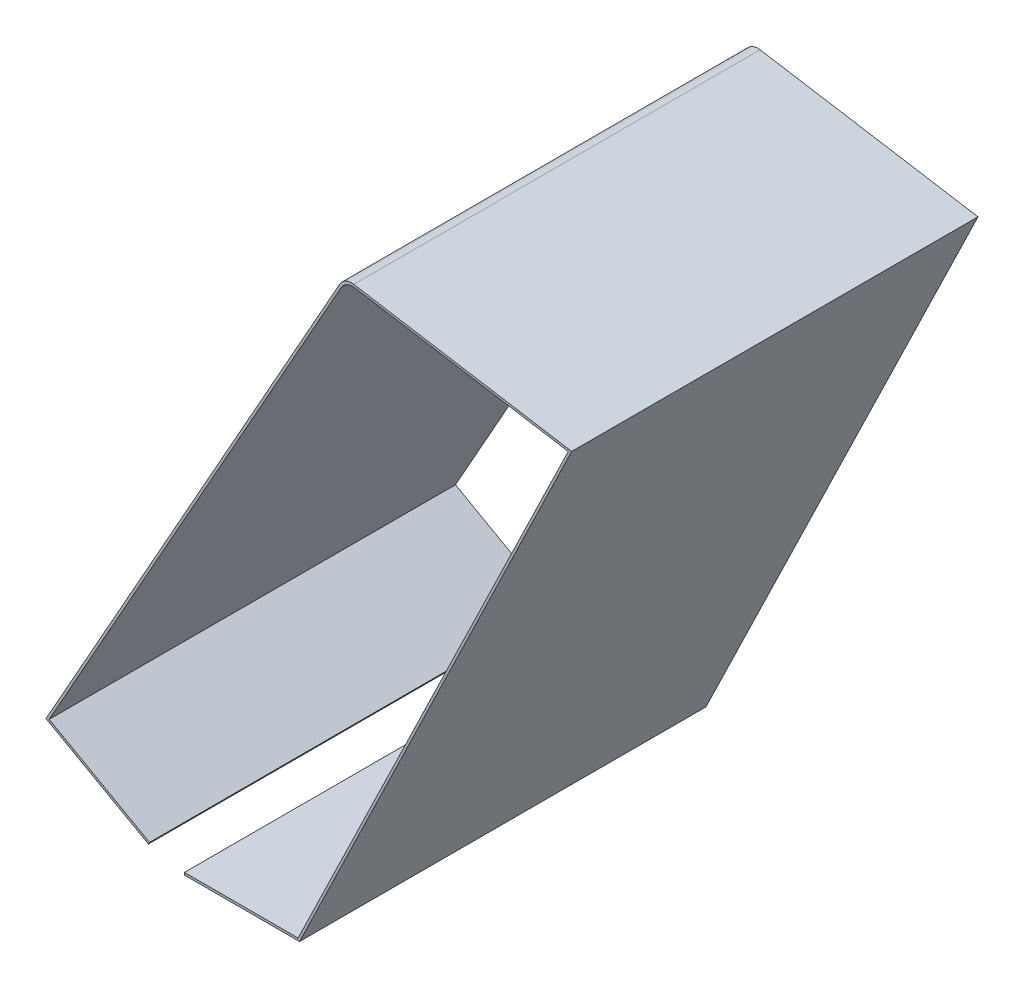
ISO-10303-21;
HEADER;
FILE_DESCRIPTION(('STEP AP214'),'2;1');
FILE_NAME('part.step','',(''),(''),'','','');
FILE_SCHEMA(('AUTOMOTIVE_DESIGN { 1 0 10303 214 1 1 1 1 }'));
ENDSEC;
DATA;
#1=APPLICATION_CONTEXT('core data for automotive mechanical design processes');
#2=APPLICATION_PROTOCOL_DEFINITION('international standard','automotive_design',2000,#1);
#3=PRODUCT_CONTEXT('',#1,'mechanical');
#4=PRODUCT('Part','Part','',(#3));
#5=PRODUCT_RELATED_PRODUCT_CATEGORY('part','',(#4));
#6=PRODUCT_DEFINITION_FORMATION('','',#4);
#7=PRODUCT_DEFINITION_CONTEXT('part definition',#1,'design');
#8=PRODUCT_DEFINITION('design','',#6,#7);
#9=PRODUCT_DEFINITION_SHAPE('','',#8);
#10=(LENGTH_UNIT() NAMED_UNIT(*) SI_UNIT(.MILLI.,.METRE.));
#11=(NAMED_UNIT(*) PLANE_ANGLE_UNIT() SI_UNIT($,.RADIAN.));
#12=(NAMED_UNIT(*) SI_UNIT($,.STERADIAN.) SOLID_ANGLE_UNIT());
#13=UNCERTAINTY_MEASURE_WITH_UNIT(LENGTH_MEASURE(1.E-05),#10,'distance_accuracy_value','');
#14=(GEOMETRIC_REPRESENTATION_CONTEXT(3) GLOBAL_UNCERTAINTY_ASSIGNED_CONTEXT((#13)) GLOBAL_UNIT_ASSIGNED_CONTEXT((#10,
#11,#12)) REPRESENTATION_CONTEXT('',''));
#15=CARTESIAN_POINT('',(0.,0.,0.));
#16=DIRECTION('',(0.,0.,1.));
#17=DIRECTION('',(1.,0.,0.));
#18=AXIS2_PLACEMENT_3D('',#15,#16,#17);
#19=CARTESIAN_POINT('',(-22.0333053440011,-39.2368889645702,30.));
#20=DIRECTION('',(0.48962900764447,0.871930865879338,0.));
#21=DIRECTION('',(-0.871930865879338,0.48962900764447,0.));
#22=AXIS2_PLACEMENT_3D('',#19,#20,#21);
#23=PLANE('',#22);
#24=DIRECTION('',(0.871930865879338,-0.48962900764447,0.));
#25=VECTOR('',#24,1.);
#26=CARTESIAN_POINT('',(-22.0333053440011,-39.2368889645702,0.));
#27=LINE('',#26,#25);
#28=CARTESIAN_POINT('',(-22.0333053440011,-39.2368889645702,0.));
#29=VERTEX_POINT('',#28);
#30=CARTESIAN_POINT('',(-14.4736647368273,-43.4819724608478,0.));
#31=VERTEX_POINT('',#30);
#32=EDGE_CURVE('E169',#29,#31,#27,.T.);
#33=ORIENTED_EDGE('',*,*,#32,.T.);
#34=DIRECTION('',(0.,0.,-1.));
#35=VECTOR('',#34,1.);
#36=CARTESIAN_POINT('',(-14.4736647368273,-43.4819724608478,30.));
#37=LINE('',#36,#35);
#38=CARTESIAN_POINT('',(-14.4736647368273,-43.4819724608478,30.));
#39=VERTEX_POINT('',#38);
#40=EDGE_CURVE('E11',#39,#31,#37,.T.);
#41=ORIENTED_EDGE('',*,*,#40,.F.);
#42=DIRECTION('',(0.871930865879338,-0.48962900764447,0.));
#43=VECTOR('',#42,1.);
#44=CARTESIAN_POINT('',(-22.0333053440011,-39.2368889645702,30.));
#45=LINE('',#44,#43);
#46=CARTESIAN_POINT('',(-22.0333053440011,-39.2368889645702,30.));
#47=VERTEX_POINT('',#46);
#48=EDGE_CURVE('E195',#47,#39,#45,.T.);
#49=ORIENTED_EDGE('',*,*,#48,.F.);
#50=DIRECTION('',(0.,0.,-1.));
#51=VECTOR('',#50,1.);
#52=CARTESIAN_POINT('',(-22.0333053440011,-39.2368889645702,30.));
#53=LINE('',#52,#51);
#54=EDGE_CURVE('E165',#47,#29,#53,.T.);
#55=ORIENTED_EDGE('',*,*,#54,.T.);
#56=EDGE_LOOP('',(#33,#41,#49,#55));
#57=FACE_BOUND('',#56,.T.);
#58=ADVANCED_FACE('F37',(#57),#23,.F.);
#59=CARTESIAN_POINT('',(-14.3904278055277,-43.3337442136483,30.));
#60=DIRECTION('',(-0.871930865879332,0.489629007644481,0.));
#61=DIRECTION('',(-0.489629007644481,-0.871930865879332,0.));
#62=AXIS2_PLACEMENT_3D('',#59,#60,#61);
#63=PLANE('',#62);
#64=DIRECTION('',(0.489629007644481,0.871930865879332,0.));
#65=VECTOR('',#64,1.);
#66=CARTESIAN_POINT('',(-14.3904278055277,-43.3337442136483,0.));
#67=LINE('',#66,#65);
#68=CARTESIAN_POINT('',(-14.3904278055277,-43.3337442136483,0.));
#69=VERTEX_POINT('',#68);
#70=EDGE_CURVE('E172',#31,#69,#67,.T.);
#71=ORIENTED_EDGE('',*,*,#70,.T.);
#72=DIRECTION('',(0.,0.,-1.));
#73=VECTOR('',#72,1.);
#74=CARTESIAN_POINT('',(-14.3904278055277,-43.3337442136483,30.));
#75=LINE('',#74,#73);
#76=CARTESIAN_POINT('',(-14.3904278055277,-43.3337442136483,30.));
#77=VERTEX_POINT('',#76);
#78=EDGE_CURVE('E45',#77,#69,#75,.T.);
#79=ORIENTED_EDGE('',*,*,#78,.F.);
#80=DIRECTION('',(0.489629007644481,0.871930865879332,0.));
#81=VECTOR('',#80,1.);
#82=CARTESIAN_POINT('',(-14.3904278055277,-43.3337442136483,30.));
#83=LINE('',#82,#81);
#84=EDGE_CURVE('E114',#39,#77,#83,.T.);
#85=ORIENTED_EDGE('',*,*,#84,.F.);
#86=ORIENTED_EDGE('',*,*,#40,.T.);
#87=EDGE_LOOP('',(#71,#79,#85,#86));
#88=FACE_BOUND('',#87,.T.);
#89=ADVANCED_FACE('F283',(#88),#63,.F.);
#90=CARTESIAN_POINT('',(-21.8018401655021,-39.1718976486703,30.));
#91=DIRECTION('',(-0.48962900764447,-0.871930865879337,0.));
#92=DIRECTION('',(0.871930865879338,-0.48962900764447,0.));
#93=AXIS2_PLACEMENT_3D('',#90,#91,#92);
#94=PLANE('',#93);
#95=DIRECTION('',(-0.871930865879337,0.48962900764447,0.));
#96=VECTOR('',#95,1.);
#97=CARTESIAN_POINT('',(-21.8018401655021,-39.1718976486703,0.));
#98=LINE('',#97,#96);
#99=CARTESIAN_POINT('',(-21.8018401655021,-39.1718976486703,0.));
#100=VERTEX_POINT('',#99);
#101=EDGE_CURVE('E174',#69,#100,#98,.T.);
#102=ORIENTED_EDGE('',*,*,#101,.T.);
#103=DIRECTION('',(0.,0.,-1.));
#104=VECTOR('',#103,1.);
#105=CARTESIAN_POINT('',(-21.8018401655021,-39.1718976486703,30.));
#106=LINE('',#105,#104);
#107=CARTESIAN_POINT('',(-21.8018401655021,-39.1718976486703,30.));
#108=VERTEX_POINT('',#107);
#109=EDGE_CURVE('E220',#108,#100,#106,.T.);
#110=ORIENTED_EDGE('',*,*,#109,.F.);
#111=DIRECTION('',(-0.871930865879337,0.48962900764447,0.));
#112=VECTOR('',#111,1.);
#113=CARTESIAN_POINT('',(-21.8018401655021,-39.1718976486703,30.));
#114=LINE('',#113,#112);
#115=EDGE_CURVE('E228',#77,#108,#114,.T.);
#116=ORIENTED_EDGE('',*,*,#115,.F.);
#117=ORIENTED_EDGE('',*,*,#78,.T.);
#118=EDGE_LOOP('',(#102,#110,#116,#117));
#119=FACE_BOUND('',#118,.T.);
#120=ADVANCED_FACE('F226',(#119),#94,.F.);
#121=CARTESIAN_POINT('',(-0.252896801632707,-0.797560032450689,30.));
#122=DIRECTION('',(-0.871930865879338,0.48962900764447,0.));
#123=DIRECTION('',(-0.48962900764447,-0.871930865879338,0.));
#124=AXIS2_PLACEMENT_3D('',#121,#122,#123);
#125=PLANE('',#124);
#126=DIRECTION('',(0.48962900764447,0.871930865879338,0.));
#127=VECTOR('',#126,1.);
#128=CARTESIAN_POINT('',(-0.252896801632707,-0.797560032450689,0.));
#129=LINE('',#128,#127);
#130=CARTESIAN_POINT('',(-0.252896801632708,-0.797560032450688,0.));
#131=VERTEX_POINT('',#130);
#132=EDGE_CURVE('E176',#100,#131,#129,.T.);
#133=ORIENTED_EDGE('',*,*,#132,.T.);
#134=DIRECTION('',(0.,0.,-1.));
#135=VECTOR('',#134,1.);
#136=CARTESIAN_POINT('',(-0.252896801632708,-0.797560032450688,30.));
#137=LINE('',#136,#135);
#138=CARTESIAN_POINT('',(-0.252896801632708,-0.797560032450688,30.));
#139=VERTEX_POINT('',#138);
#140=EDGE_CURVE('E217',#139,#131,#137,.T.);
#141=ORIENTED_EDGE('',*,*,#140,.F.);
#142=DIRECTION('',(0.48962900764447,0.871930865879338,0.));
#143=VECTOR('',#142,1.);
#144=CARTESIAN_POINT('',(-0.252896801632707,-0.797560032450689,30.));
#145=LINE('',#144,#143);
#146=EDGE_CURVE('E246',#108,#139,#145,.T.);
#147=ORIENTED_EDGE('',*,*,#146,.F.);
#148=ORIENTED_EDGE('',*,*,#109,.T.);
#149=EDGE_LOOP('',(#133,#141,#147,#148));
#150=FACE_BOUND('',#149,.T.);
#151=ADVANCED_FACE('F237',(#150),#125,.F.);
#152=CARTESIAN_POINT('',(0.61903406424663,-1.28718904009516,30.));
#153=DIRECTION('',(0.,0.,-1.));
#154=DIRECTION('',(-1.,0.,0.));
#155=AXIS2_PLACEMENT_3D('',#152,#153,#154);
#156=CYLINDRICAL_SURFACE('',#155,1.);
#157=CARTESIAN_POINT('',(0.61903406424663,-1.28718904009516,0.));
#158=DIRECTION('',(0.,0.,-1.));
#159=DIRECTION('',(1.,0.,0.));
#160=AXIS2_PLACEMENT_3D('',#157,#158,#159);
#161=CIRCLE('',#160,1.);
#162=CARTESIAN_POINT('',(0.780916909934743,-0.300379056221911,0.));
#163=VERTEX_POINT('',#162);
#164=EDGE_CURVE('E178',#131,#163,#161,.T.);
#165=ORIENTED_EDGE('',*,*,#164,.T.);
#166=DIRECTION('',(0.,0.,-1.));
#167=VECTOR('',#166,1.);
#168=CARTESIAN_POINT('',(0.780916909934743,-0.300379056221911,30.));
#169=LINE('',#168,#167);
#170=CARTESIAN_POINT('',(0.780916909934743,-0.300379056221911,30.));
#171=VERTEX_POINT('',#170);
#172=EDGE_CURVE('E214',#171,#163,#169,.T.);
#173=ORIENTED_EDGE('',*,*,#172,.F.);
#174=CARTESIAN_POINT('',(0.61903406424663,-1.28718904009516,30.));
#175=DIRECTION('',(0.,0.,-1.));
#176=DIRECTION('',(1.,0.,0.));
#177=AXIS2_PLACEMENT_3D('',#174,#175,#176);
#178=CIRCLE('',#177,1.);
#179=EDGE_CURVE('E243',#139,#171,#178,.T.);
#180=ORIENTED_EDGE('',*,*,#179,.F.);
#181=ORIENTED_EDGE('',*,*,#140,.T.);
#182=EDGE_LOOP('',(#165,#173,#180,#181));
#183=FACE_BOUND('',#182,.T.);
#184=ADVANCED_FACE('F241',(#183),#156,.F.);
#185=CARTESIAN_POINT('',(16.5232694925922,-2.8828588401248,30.));
#186=DIRECTION('',(0.161882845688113,0.986809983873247,0.));
#187=DIRECTION('',(-0.986809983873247,0.161882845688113,0.));
#188=AXIS2_PLACEMENT_3D('',#185,#186,#187);
#189=PLANE('',#188);
#190=DIRECTION('',(0.986809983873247,-0.161882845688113,0.));
#191=VECTOR('',#190,1.);
#192=CARTESIAN_POINT('',(16.5232694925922,-2.8828588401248,0.));
#193=LINE('',#192,#191);
#194=CARTESIAN_POINT('',(16.5232694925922,-2.8828588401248,0.));
#195=VERTEX_POINT('',#194);
#196=EDGE_CURVE('E180',#163,#195,#193,.T.);
#197=ORIENTED_EDGE('',*,*,#196,.T.);
#198=DIRECTION('',(0.,0.,-1.));
#199=VECTOR('',#198,1.);
#200=CARTESIAN_POINT('',(16.5232694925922,-2.8828588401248,30.));
#201=LINE('',#200,#199);
#202=CARTESIAN_POINT('',(16.5232694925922,-2.8828588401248,30.));
#203=VERTEX_POINT('',#202);
#204=EDGE_CURVE('E211',#203,#195,#201,.T.);
#205=ORIENTED_EDGE('',*,*,#204,.F.);
#206=DIRECTION('',(0.986809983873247,-0.161882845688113,0.));
#207=VECTOR('',#206,1.);
#208=CARTESIAN_POINT('',(16.5232694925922,-2.8828588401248,30.));
#209=LINE('',#208,#207);
#210=EDGE_CURVE('E245',#171,#203,#209,.T.);
#211=ORIENTED_EDGE('',*,*,#210,.F.);
#212=ORIENTED_EDGE('',*,*,#172,.T.);
#213=EDGE_LOOP('',(#197,#205,#211,#212));
#214=FACE_BOUND('',#213,.T.);
#215=ADVANCED_FACE('F296',(#214),#189,.F.);
#216=CARTESIAN_POINT('',(-3.4204397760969,-43.9631790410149,30.));
#217=DIRECTION('',(0.899590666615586,-0.436734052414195,0.));
#218=DIRECTION('',(0.436734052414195,0.899590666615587,0.));
#219=AXIS2_PLACEMENT_3D('',#216,#217,#218);
#220=PLANE('',#219);
#221=DIRECTION('',(-0.436734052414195,-0.899590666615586,0.));
#222=VECTOR('',#221,1.);
#223=CARTESIAN_POINT('',(-3.4204397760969,-43.9631790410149,0.));
#224=LINE('',#223,#222);
#225=CARTESIAN_POINT('',(-3.4204397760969,-43.9631790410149,0.));
#226=VERTEX_POINT('',#225);
#227=EDGE_CURVE('E182',#195,#226,#224,.T.);
#228=ORIENTED_EDGE('',*,*,#227,.T.);
#229=DIRECTION('',(0.,0.,-1.));
#230=VECTOR('',#229,1.);
#231=CARTESIAN_POINT('',(-3.4204397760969,-43.9631790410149,30.));
#232=LINE('',#231,#230);
#233=CARTESIAN_POINT('',(-3.4204397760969,-43.9631790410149,30.));
#234=VERTEX_POINT('',#233);
#235=EDGE_CURVE('E208',#234,#226,#232,.T.);
#236=ORIENTED_EDGE('',*,*,#235,.F.);
#237=DIRECTION('',(-0.436734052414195,-0.899590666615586,0.));
#238=VECTOR('',#237,1.);
#239=CARTESIAN_POINT('',(-3.4204397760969,-43.9631790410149,30.));
#240=LINE('',#239,#238);
#241=EDGE_CURVE('E248',#203,#234,#240,.T.);
#242=ORIENTED_EDGE('',*,*,#241,.F.);
#243=ORIENTED_EDGE('',*,*,#204,.T.);
#244=EDGE_LOOP('',(#228,#236,#242,#243));
#245=FACE_BOUND('',#244,.T.);
#246=ADVANCED_FACE('F299',(#245),#220,.F.);
#247=CARTESIAN_POINT('',(-11.8139966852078,-43.9631790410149,30.));
#248=DIRECTION('',(0.,-1.,0.));
#249=DIRECTION('',(0.,0.,-1.));
#250=AXIS2_PLACEMENT_3D('',#247,#248,#249);
#251=PLANE('',#250);
#252=DIRECTION('',(-1.,0.,0.));
#253=VECTOR('',#252,1.);
#254=CARTESIAN_POINT('',(-11.8139966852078,-43.9631790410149,0.));
#255=LINE('',#254,#253);
#256=CARTESIAN_POINT('',(-11.8139966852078,-43.9631790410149,0.));
#257=VERTEX_POINT('',#256);
#258=EDGE_CURVE('E184',#226,#257,#255,.T.);
#259=ORIENTED_EDGE('',*,*,#258,.T.);
#260=DIRECTION('',(0.,0.,-1.));
#261=VECTOR('',#260,1.);
#262=CARTESIAN_POINT('',(-11.8139966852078,-43.9631790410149,30.));
#263=LINE('',#262,#261);
#264=CARTESIAN_POINT('',(-11.8139966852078,-43.9631790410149,30.));
#265=VERTEX_POINT('',#264);
#266=EDGE_CURVE('E205',#265,#257,#263,.T.);
#267=ORIENTED_EDGE('',*,*,#266,.F.);
#268=DIRECTION('',(-1.,0.,0.));
#269=VECTOR('',#268,1.);
#270=CARTESIAN_POINT('',(-11.8139966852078,-43.9631790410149,30.));
#271=LINE('',#270,#269);
#272=EDGE_CURVE('E254',#234,#265,#271,.T.);
#273=ORIENTED_EDGE('',*,*,#272,.F.);
#274=ORIENTED_EDGE('',*,*,#235,.T.);
#275=EDGE_LOOP('',(#259,#267,#273,#274));
#276=FACE_BOUND('',#275,.T.);
#277=ADVANCED_FACE('F303',(#276),#251,.F.);
#278=CARTESIAN_POINT('',(-11.8139966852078,-44.1331790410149,30.));
#279=DIRECTION('',(1.,0.,0.));
#280=DIRECTION('',(0.,0.,-1.));
#281=AXIS2_PLACEMENT_3D('',#278,#279,#280);
#282=PLANE('',#281);
#283=DIRECTION('',(0.,-1.,0.));
#284=VECTOR('',#283,1.);
#285=CARTESIAN_POINT('',(-11.8139966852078,-44.1331790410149,0.));
#286=LINE('',#285,#284);
#287=CARTESIAN_POINT('',(-11.8139966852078,-44.1331790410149,0.));
#288=VERTEX_POINT('',#287);
#289=EDGE_CURVE('E186',#257,#288,#286,.T.);
#290=ORIENTED_EDGE('',*,*,#289,.T.);
#291=DIRECTION('',(0.,0.,-1.));
#292=VECTOR('',#291,1.);
#293=CARTESIAN_POINT('',(-11.8139966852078,-44.1331790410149,30.));
#294=LINE('',#293,#292);
#295=CARTESIAN_POINT('',(-11.8139966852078,-44.1331790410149,30.));
#296=VERTEX_POINT('',#295);
#297=EDGE_CURVE('E202',#296,#288,#294,.T.);
#298=ORIENTED_EDGE('',*,*,#297,.F.);
#299=DIRECTION('',(0.,-1.,0.));
#300=VECTOR('',#299,1.);
#301=CARTESIAN_POINT('',(-11.8139966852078,-44.1331790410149,30.));
#302=LINE('',#301,#300);
#303=EDGE_CURVE('E256',#265,#296,#302,.T.);
#304=ORIENTED_EDGE('',*,*,#303,.F.);
#305=ORIENTED_EDGE('',*,*,#266,.T.);
#306=EDGE_LOOP('',(#290,#298,#304,#305));
#307=FACE_BOUND('',#306,.T.);
#308=ADVANCED_FACE('F307',(#307),#282,.F.);
#309=CARTESIAN_POINT('',(-3.31399668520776,-44.1331790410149,30.));
#310=DIRECTION('',(0.,1.,0.));
#311=DIRECTION('',(0.,0.,1.));
#312=AXIS2_PLACEMENT_3D('',#309,#310,#311);
#313=PLANE('',#312);
#314=DIRECTION('',(1.,0.,0.));
#315=VECTOR('',#314,1.);
#316=CARTESIAN_POINT('',(-3.31399668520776,-44.1331790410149,0.));
#317=LINE('',#316,#315);
#318=CARTESIAN_POINT('',(-3.31399668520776,-44.1331790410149,0.));
#319=VERTEX_POINT('',#318);
#320=EDGE_CURVE('E188',#288,#319,#317,.T.);
#321=ORIENTED_EDGE('',*,*,#320,.T.);
#322=DIRECTION('',(0.,0.,-1.));
#323=VECTOR('',#322,1.);
#324=CARTESIAN_POINT('',(-3.31399668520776,-44.1331790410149,30.));
#325=LINE('',#324,#323);
#326=CARTESIAN_POINT('',(-3.31399668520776,-44.1331790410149,30.));
#327=VERTEX_POINT('',#326);
#328=EDGE_CURVE('E199',#327,#319,#325,.T.);
#329=ORIENTED_EDGE('',*,*,#328,.F.);
#330=DIRECTION('',(1.,0.,0.));
#331=VECTOR('',#330,1.);
#332=CARTESIAN_POINT('',(-3.31399668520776,-44.1331790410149,30.));
#333=LINE('',#332,#331);
#334=EDGE_CURVE('E258',#296,#327,#333,.T.);
#335=ORIENTED_EDGE('',*,*,#334,.F.);
#336=ORIENTED_EDGE('',*,*,#297,.T.);
#337=EDGE_LOOP('',(#321,#329,#335,#336));
#338=FACE_BOUND('',#337,.T.);
#339=ADVANCED_FACE('F264',(#338),#313,.F.);
#340=CARTESIAN_POINT('',(-3.31399668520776,-44.1331790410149,30.));
#341=DIRECTION('',(-0.899590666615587,0.436734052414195,0.));
#342=DIRECTION('',(-0.436734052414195,-0.899590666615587,0.));
#343=AXIS2_PLACEMENT_3D('',#340,#341,#342);
#344=PLANE('',#343);
#345=DIRECTION('',(0.436734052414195,0.899590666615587,0.));
#346=VECTOR('',#345,1.);
#347=CARTESIAN_POINT('',(-3.31399668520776,-44.1331790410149,0.));
#348=LINE('',#347,#346);
#349=CARTESIAN_POINT('',(16.7757697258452,-2.75200837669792,0.));
#350=VERTEX_POINT('',#349);
#351=EDGE_CURVE('E190',#319,#350,#348,.T.);
#352=ORIENTED_EDGE('',*,*,#351,.T.);
#353=DIRECTION('',(0.,0.,-1.));
#354=VECTOR('',#353,1.);
#355=CARTESIAN_POINT('',(16.7757697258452,-2.75200837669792,30.));
#356=LINE('',#355,#354);
#357=CARTESIAN_POINT('',(16.7757697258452,-2.75200837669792,30.));
#358=VERTEX_POINT('',#357);
#359=EDGE_CURVE('E160',#358,#350,#356,.T.);
#360=ORIENTED_EDGE('',*,*,#359,.F.);
#361=DIRECTION('',(0.436734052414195,0.899590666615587,0.));
#362=VECTOR('',#361,1.);
#363=CARTESIAN_POINT('',(-3.31399668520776,-44.1331790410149,30.));
#364=LINE('',#363,#362);
#365=EDGE_CURVE('E151',#327,#358,#364,.T.);
#366=ORIENTED_EDGE('',*,*,#365,.F.);
#367=ORIENTED_EDGE('',*,*,#328,.T.);
#368=EDGE_LOOP('',(#352,#360,#366,#367));
#369=FACE_BOUND('',#368,.T.);
#370=ADVANCED_FACE('F268',(#369),#344,.F.);
#371=CARTESIAN_POINT('',(16.7757697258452,-2.75200837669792,30.));
#372=DIRECTION('',(-0.161882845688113,-0.986809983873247,0.));
#373=DIRECTION('',(0.986809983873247,-0.161882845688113,0.));
#374=AXIS2_PLACEMENT_3D('',#371,#372,#373);
#375=PLANE('',#374);
#376=DIRECTION('',(-0.986809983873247,0.161882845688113,0.));
#377=VECTOR('',#376,1.);
#378=CARTESIAN_POINT('',(16.7757697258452,-2.75200837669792,0.));
#379=LINE('',#378,#377);
#380=CARTESIAN_POINT('',(0.690971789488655,-0.113351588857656,0.));
#381=VERTEX_POINT('',#380);
#382=EDGE_CURVE('E159',#350,#381,#379,.T.);
#383=ORIENTED_EDGE('',*,*,#382,.T.);
#384=DIRECTION('',(0.,0.,-1.));
#385=VECTOR('',#384,1.);
#386=CARTESIAN_POINT('',(0.690971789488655,-0.113351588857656,30.));
#387=LINE('',#386,#385);
#388=CARTESIAN_POINT('',(0.690971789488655,-0.113351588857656,30.));
#389=VERTEX_POINT('',#388);
#390=EDGE_CURVE('E156',#389,#381,#387,.T.);
#391=ORIENTED_EDGE('',*,*,#390,.F.);
#392=DIRECTION('',(-0.986809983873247,0.161882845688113,0.));
#393=VECTOR('',#392,1.);
#394=CARTESIAN_POINT('',(16.7757697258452,-2.75200837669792,30.));
#395=LINE('',#394,#393);
#396=EDGE_CURVE('E145',#358,#389,#395,.T.);
#397=ORIENTED_EDGE('',*,*,#396,.F.);
#398=ORIENTED_EDGE('',*,*,#359,.T.);
#399=EDGE_LOOP('',(#383,#391,#397,#398));
#400=FACE_BOUND('',#399,.T.);
#401=ADVANCED_FACE('F157',(#400),#375,.F.);
#402=CARTESIAN_POINT('',(0.529088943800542,-1.1001615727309,30.));
#403=DIRECTION('',(0.,0.,-1.));
#404=DIRECTION('',(-1.,0.,0.));
#405=AXIS2_PLACEMENT_3D('',#402,#403,#404);
#406=CYLINDRICAL_SURFACE('',#405,1.);
#407=CARTESIAN_POINT('',(0.529088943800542,-1.1001615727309,0.));
#408=DIRECTION('',(0.,0.,1.));
#409=DIRECTION('',(-1.,0.,0.));
#410=AXIS2_PLACEMENT_3D('',#407,#408,#409);
#411=CIRCLE('',#410,1.);
#412=CARTESIAN_POINT('',(-0.342841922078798,-0.610532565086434,0.));
#413=VERTEX_POINT('',#412);
#414=EDGE_CURVE('E100',#381,#413,#411,.T.);
#415=ORIENTED_EDGE('',*,*,#414,.T.);
#416=DIRECTION('',(0.,0.,-1.));
#417=VECTOR('',#416,1.);
#418=CARTESIAN_POINT('',(-0.342841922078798,-0.610532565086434,30.));
#419=LINE('',#418,#417);
#420=CARTESIAN_POINT('',(-0.342841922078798,-0.610532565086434,30.));
#421=VERTEX_POINT('',#420);
#422=EDGE_CURVE('E161',#421,#413,#419,.T.);
#423=ORIENTED_EDGE('',*,*,#422,.F.);
#424=CARTESIAN_POINT('',(0.529088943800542,-1.1001615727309,30.));
#425=DIRECTION('',(0.,0.,1.));
#426=DIRECTION('',(-1.,0.,0.));
#427=AXIS2_PLACEMENT_3D('',#424,#425,#426);
#428=CIRCLE('',#427,1.);
#429=EDGE_CURVE('E149',#389,#421,#428,.T.);
#430=ORIENTED_EDGE('',*,*,#429,.F.);
#431=ORIENTED_EDGE('',*,*,#390,.T.);
#432=EDGE_LOOP('',(#415,#423,#430,#431));
#433=FACE_BOUND('',#432,.T.);
#434=ADVANCED_FACE('F163',(#433),#406,.T.);
#435=CARTESIAN_POINT('',(-0.342841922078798,-0.610532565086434,30.));
#436=DIRECTION('',(0.871930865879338,-0.48962900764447,0.));
#437=DIRECTION('',(0.48962900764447,0.871930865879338,0.));
#438=AXIS2_PLACEMENT_3D('',#435,#436,#437);
#439=PLANE('',#438);
#440=DIRECTION('',(-0.48962900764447,-0.871930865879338,0.));
#441=VECTOR('',#440,1.);
#442=CARTESIAN_POINT('',(-0.342841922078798,-0.610532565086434,0.));
#443=LINE('',#442,#441);
#444=EDGE_CURVE('E106',#413,#29,#443,.T.);
#445=ORIENTED_EDGE('',*,*,#444,.T.);
#446=ORIENTED_EDGE('',*,*,#54,.F.);
#447=DIRECTION('',(-0.48962900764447,-0.871930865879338,0.));
#448=VECTOR('',#447,1.);
#449=CARTESIAN_POINT('',(-0.342841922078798,-0.610532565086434,30.));
#450=LINE('',#449,#448);
#451=EDGE_CURVE('E53',#421,#47,#450,.T.);
#452=ORIENTED_EDGE('',*,*,#451,.F.);
#453=ORIENTED_EDGE('',*,*,#422,.T.);
#454=EDGE_LOOP('',(#445,#446,#452,#453));
#455=FACE_BOUND('',#454,.T.);
#456=ADVANCED_FACE('F272',(#455),#439,.F.);
#457=CARTESIAN_POINT('',(0.61903406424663,-1.28718904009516,30.));
#458=DIRECTION('',(0.,0.,1.));
#459=DIRECTION('',(1.,0.,0.));
#460=AXIS2_PLACEMENT_3D('',#457,#458,#459);
#461=PLANE('',#460);
#462=ORIENTED_EDGE('',*,*,#48,.T.);
#463=ORIENTED_EDGE('',*,*,#84,.T.);
#464=ORIENTED_EDGE('',*,*,#115,.T.);
#465=ORIENTED_EDGE('',*,*,#146,.T.);
#466=ORIENTED_EDGE('',*,*,#179,.T.);
#467=ORIENTED_EDGE('',*,*,#210,.T.);
#468=ORIENTED_EDGE('',*,*,#241,.T.);
#469=ORIENTED_EDGE('',*,*,#272,.T.);
#470=ORIENTED_EDGE('',*,*,#303,.T.);
#471=ORIENTED_EDGE('',*,*,#334,.T.);
#472=ORIENTED_EDGE('',*,*,#365,.T.);
#473=ORIENTED_EDGE('',*,*,#396,.T.);
#474=ORIENTED_EDGE('',*,*,#429,.T.);
#475=ORIENTED_EDGE('',*,*,#451,.T.);
#476=EDGE_LOOP('',(#462,#463,#464,#465,#466,#467,#468,#469,#470,#471,#472,#473,#474,#475));
#477=FACE_BOUND('',#476,.T.);
#478=ADVANCED_FACE('F147',(#477),#461,.T.);
#479=CARTESIAN_POINT('',(0.61903406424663,-1.28718904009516,0.));
#480=DIRECTION('',(0.,0.,1.));
#481=DIRECTION('',(1.,0.,0.));
#482=AXIS2_PLACEMENT_3D('',#479,#480,#481);
#483=PLANE('',#482);
#484=ORIENTED_EDGE('',*,*,#32,.F.);
#485=ORIENTED_EDGE('',*,*,#444,.F.);
#486=ORIENTED_EDGE('',*,*,#414,.F.);
#487=ORIENTED_EDGE('',*,*,#382,.F.);
#488=ORIENTED_EDGE('',*,*,#351,.F.);
#489=ORIENTED_EDGE('',*,*,#320,.F.);
#490=ORIENTED_EDGE('',*,*,#289,.F.);
#491=ORIENTED_EDGE('',*,*,#258,.F.);
#492=ORIENTED_EDGE('',*,*,#227,.F.);
#493=ORIENTED_EDGE('',*,*,#196,.F.);
#494=ORIENTED_EDGE('',*,*,#164,.F.);
#495=ORIENTED_EDGE('',*,*,#132,.F.);
#496=ORIENTED_EDGE('',*,*,#101,.F.);
#497=ORIENTED_EDGE('',*,*,#70,.F.);
#498=EDGE_LOOP('',(#484,#485,#486,#487,#488,#489,#490,#491,#492,#493,#494,#495,#496,#497));
#499=FACE_BOUND('',#498,.T.);
#500=ADVANCED_FACE('F232',(#499),#483,.F.);
#501=CLOSED_SHELL('',(#58,#89,#120,#151,#184,#215,#246,#277,#308,#339,#370,#401,#434,#456,#478,#500));
#502=MANIFOLD_SOLID_BREP('B2',#501);
#503=ADVANCED_BREP_SHAPE_REPRESENTATION('',(#18,#502),#14);
#504=SHAPE_DEFINITION_REPRESENTATION(#9,#503);
ENDSEC;
END-ISO-10303-21;
